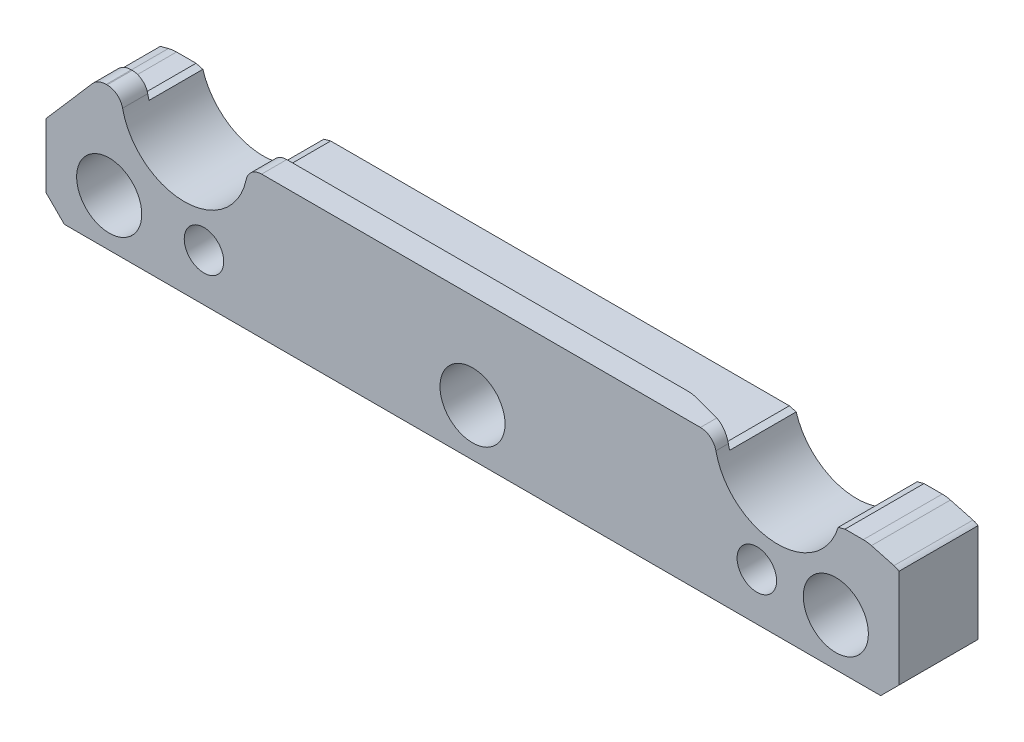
ISO-10303-21;
HEADER;
FILE_DESCRIPTION(('STEP AP214'),'2;1');
FILE_NAME('part.step','',(''),(''),'','','');
FILE_SCHEMA(('AUTOMOTIVE_DESIGN { 1 0 10303 214 1 1 1 1 }'));
ENDSEC;
DATA;
#1=APPLICATION_CONTEXT('core data for automotive mechanical design processes');
#2=APPLICATION_PROTOCOL_DEFINITION('international standard','automotive_design',2000,#1);
#3=PRODUCT_CONTEXT('',#1,'mechanical');
#4=PRODUCT('Part','Part','',(#3));
#5=PRODUCT_RELATED_PRODUCT_CATEGORY('part','',(#4));
#6=PRODUCT_DEFINITION_FORMATION('','',#4);
#7=PRODUCT_DEFINITION_CONTEXT('part definition',#1,'design');
#8=PRODUCT_DEFINITION('design','',#6,#7);
#9=PRODUCT_DEFINITION_SHAPE('','',#8);
#10=(LENGTH_UNIT() NAMED_UNIT(*) SI_UNIT(.MILLI.,.METRE.));
#11=(NAMED_UNIT(*) PLANE_ANGLE_UNIT() SI_UNIT($,.RADIAN.));
#12=(NAMED_UNIT(*) SI_UNIT($,.STERADIAN.) SOLID_ANGLE_UNIT());
#13=UNCERTAINTY_MEASURE_WITH_UNIT(LENGTH_MEASURE(1.E-05),#10,'distance_accuracy_value','');
#14=(GEOMETRIC_REPRESENTATION_CONTEXT(3) GLOBAL_UNCERTAINTY_ASSIGNED_CONTEXT((#13)) GLOBAL_UNIT_ASSIGNED_CONTEXT((#10,
#11,#12)) REPRESENTATION_CONTEXT('',''));
#15=CARTESIAN_POINT('',(0.,0.,0.));
#16=DIRECTION('',(0.,0.,1.));
#17=DIRECTION('',(1.,0.,0.));
#18=AXIS2_PLACEMENT_3D('',#15,#16,#17);
#19=CARTESIAN_POINT('',(-166.06299335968,-88.011,0.));
#20=DIRECTION('',(0.,0.,1.));
#21=DIRECTION('',(1.,0.,0.));
#22=AXIS2_PLACEMENT_3D('',#19,#20,#21);
#23=PLANE('',#22);
#24=CARTESIAN_POINT('',(-187.452,-97.536,0.));
#25=DIRECTION('',(0.,0.,-1.));
#26=DIRECTION('',(-1.,0.,0.));
#27=AXIS2_PLACEMENT_3D('',#24,#25,#26);
#28=CIRCLE('',#27,3.96874999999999);
#29=CARTESIAN_POINT('',(-191.42075,-97.536,0.));
#30=VERTEX_POINT('',#29);
#31=EDGE_CURVE('E272',#30,#30,#28,.T.);
#32=ORIENTED_EDGE('',*,*,#31,.F.);
#33=EDGE_LOOP('',(#32));
#34=FACE_BOUND('',#33,.T.);
#35=CARTESIAN_POINT('',(-171.577,-97.536,0.));
#36=DIRECTION('',(0.,0.,1.));
#37=DIRECTION('',(1.,0.,0.));
#38=AXIS2_PLACEMENT_3D('',#35,#36,#37);
#39=CIRCLE('',#38,4.36880000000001);
#40=CARTESIAN_POINT('',(-167.2082,-97.536,0.));
#41=VERTEX_POINT('',#40);
#42=EDGE_CURVE('E263',#41,#41,#39,.T.);
#43=ORIENTED_EDGE('',*,*,#42,.T.);
#44=EDGE_LOOP('',(#43));
#45=FACE_BOUND('',#44,.T.);
#46=CARTESIAN_POINT('',(-298.577,-97.536,0.));
#47=DIRECTION('',(0.,0.,-1.));
#48=DIRECTION('',(-1.,0.,0.));
#49=AXIS2_PLACEMENT_3D('',#46,#47,#48);
#50=CIRCLE('',#49,3.96875000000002);
#51=CARTESIAN_POINT('',(-302.54575,-97.536,0.));
#52=VERTEX_POINT('',#51);
#53=EDGE_CURVE('E592',#52,#52,#50,.T.);
#54=ORIENTED_EDGE('',*,*,#53,.F.);
#55=EDGE_LOOP('',(#54));
#56=FACE_BOUND('',#55,.T.);
#57=CARTESIAN_POINT('',(-317.627,-97.536,0.));
#58=DIRECTION('',(0.,0.,1.));
#59=DIRECTION('',(1.,0.,0.));
#60=AXIS2_PLACEMENT_3D('',#57,#58,#59);
#61=CIRCLE('',#60,4.36880000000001);
#62=CARTESIAN_POINT('',(-313.2582,-97.536,0.));
#63=VERTEX_POINT('',#62);
#64=EDGE_CURVE('E595',#63,#63,#61,.T.);
#65=ORIENTED_EDGE('',*,*,#64,.T.);
#66=EDGE_LOOP('',(#65));
#67=FACE_BOUND('',#66,.T.);
#68=CARTESIAN_POINT('',(-244.602,-97.536,0.));
#69=DIRECTION('',(0.,0.,1.));
#70=DIRECTION('',(1.,0.,0.));
#71=AXIS2_PLACEMENT_3D('',#68,#69,#70);
#72=CIRCLE('',#71,4.36880000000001);
#73=CARTESIAN_POINT('',(-240.2332,-97.536,0.));
#74=VERTEX_POINT('',#73);
#75=EDGE_CURVE('E607',#74,#74,#72,.T.);
#76=ORIENTED_EDGE('',*,*,#75,.T.);
#77=EDGE_LOOP('',(#76));
#78=FACE_BOUND('',#77,.T.);
#79=DIRECTION('',(0.,-1.,0.));
#80=VECTOR('',#79,1.);
#81=CARTESIAN_POINT('',(-330.327,-84.2132160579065,0.));
#82=LINE('',#81,#80);
#83=CARTESIAN_POINT('',(-330.327,-90.483615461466,0.));
#84=VERTEX_POINT('',#83);
#85=CARTESIAN_POINT('',(-330.327,-103.378,0.));
#86=VERTEX_POINT('',#85);
#87=EDGE_CURVE('E294',#84,#86,#82,.T.);
#88=ORIENTED_EDGE('',*,*,#87,.F.);
#89=DIRECTION('',(0.655690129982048,0.755030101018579,0.));
#90=VECTOR('',#89,1.);
#91=CARTESIAN_POINT('',(-365.518518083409,-131.006805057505,0.));
#92=LINE('',#91,#90);
#93=CARTESIAN_POINT('',(-323.2302175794,-82.3116389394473,0.));
#94=VERTEX_POINT('',#93);
#95=EDGE_CURVE('E259',#84,#94,#92,.T.);
#96=ORIENTED_EDGE('',*,*,#95,.T.);
#97=DIRECTION('',(-0.965925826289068,-0.258819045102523,0.));
#98=VECTOR('',#97,1.);
#99=CARTESIAN_POINT('',(-321.609507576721,-81.8773710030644,0.));
#100=LINE('',#99,#98);
#101=CARTESIAN_POINT('',(-321.609507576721,-81.8773710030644,0.));
#102=VERTEX_POINT('',#101);
#103=EDGE_CURVE('E279',#102,#94,#100,.T.);
#104=ORIENTED_EDGE('',*,*,#103,.F.);
#105=CARTESIAN_POINT('',(-319.96600664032,-88.011,0.));
#106=DIRECTION('',(0.,0.,1.));
#107=DIRECTION('',(-1.,0.,0.));
#108=AXIS2_PLACEMENT_3D('',#105,#106,#107);
#109=CIRCLE('',#108,6.34999999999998);
#110=CARTESIAN_POINT('',(-319.96600664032,-81.6610000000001,0.));
#111=VERTEX_POINT('',#110);
#112=EDGE_CURVE('E285',#111,#102,#109,.T.);
#113=ORIENTED_EDGE('',*,*,#112,.F.);
#114=DIRECTION('',(-1.,0.,0.));
#115=VECTOR('',#114,1.);
#116=CARTESIAN_POINT('',(-166.06299335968,-81.661,0.));
#117=LINE('',#116,#115);
#118=CARTESIAN_POINT('',(-316.047229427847,-81.6610000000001,0.));
#119=VERTEX_POINT('',#118);
#120=EDGE_CURVE('E307',#119,#111,#117,.T.);
#121=ORIENTED_EDGE('',*,*,#120,.F.);
#122=DIRECTION('',(0.965925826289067,-0.258819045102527,0.));
#123=VECTOR('',#122,1.);
#124=CARTESIAN_POINT('',(-316.047229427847,-81.6610000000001,0.));
#125=LINE('',#124,#123);
#126=CARTESIAN_POINT('',(-314.672023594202,-82.0294852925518,0.));
#127=VERTEX_POINT('',#126);
#128=EDGE_CURVE('E693',#119,#127,#125,.T.);
#129=ORIENTED_EDGE('',*,*,#128,.T.);
#130=CARTESIAN_POINT('',(-302.514,-78.3590000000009,0.));
#131=DIRECTION('',(0.,0.,1.));
#132=DIRECTION('',(1.,0.,0.));
#133=AXIS2_PLACEMENT_3D('',#130,#131,#132);
#134=CIRCLE('',#133,12.7);
#135=CARTESIAN_POINT('',(-290.355976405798,-82.0294852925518,0.));
#136=VERTEX_POINT('',#135);
#137=EDGE_CURVE('E575',#127,#136,#134,.T.);
#138=ORIENTED_EDGE('',*,*,#137,.T.);
#139=DIRECTION('',(-0.965925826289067,-0.258819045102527,0.));
#140=VECTOR('',#139,1.);
#141=CARTESIAN_POINT('',(-288.980770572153,-81.6610000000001,0.));
#142=LINE('',#141,#140);
#143=CARTESIAN_POINT('',(-288.980770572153,-81.6610000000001,0.));
#144=VERTEX_POINT('',#143);
#145=EDGE_CURVE('E673',#136,#144,#142,.F.);
#146=ORIENTED_EDGE('',*,*,#145,.T.);
#147=CARTESIAN_POINT('',(-196.794229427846,-81.661,0.));
#148=VERTEX_POINT('',#147);
#149=EDGE_CURVE('E311',#148,#144,#117,.T.);
#150=ORIENTED_EDGE('',*,*,#149,.F.);
#151=DIRECTION('',(0.965925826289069,-0.258819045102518,0.));
#152=VECTOR('',#151,1.);
#153=CARTESIAN_POINT('',(-196.794229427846,-81.661,0.));
#154=LINE('',#153,#152);
#155=CARTESIAN_POINT('',(-195.419023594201,-82.0294852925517,0.));
#156=VERTEX_POINT('',#155);
#157=EDGE_CURVE('E689',#148,#156,#154,.T.);
#158=ORIENTED_EDGE('',*,*,#157,.T.);
#159=CARTESIAN_POINT('',(-183.261,-78.359,0.));
#160=DIRECTION('',(0.,0.,1.));
#161=DIRECTION('',(1.,0.,0.));
#162=AXIS2_PLACEMENT_3D('',#159,#160,#161);
#163=CIRCLE('',#162,12.7);
#164=CARTESIAN_POINT('',(-171.102976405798,-82.0294852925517,0.));
#165=VERTEX_POINT('',#164);
#166=EDGE_CURVE('E574',#156,#165,#163,.T.);
#167=ORIENTED_EDGE('',*,*,#166,.T.);
#168=DIRECTION('',(-0.965925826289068,-0.258819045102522,0.));
#169=VECTOR('',#168,1.);
#170=CARTESIAN_POINT('',(-169.727770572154,-81.661,0.));
#171=LINE('',#170,#169);
#172=CARTESIAN_POINT('',(-169.727770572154,-81.661,0.));
#173=VERTEX_POINT('',#172);
#174=EDGE_CURVE('E691',#165,#173,#171,.F.);
#175=ORIENTED_EDGE('',*,*,#174,.T.);
#176=CARTESIAN_POINT('',(-166.06299335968,-81.661,0.));
#177=VERTEX_POINT('',#176);
#178=EDGE_CURVE('E308',#177,#173,#117,.T.);
#179=ORIENTED_EDGE('',*,*,#178,.F.);
#180=CARTESIAN_POINT('',(-166.06299335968,-88.011,0.));
#181=DIRECTION('',(0.,0.,1.));
#182=DIRECTION('',(1.,0.,0.));
#183=AXIS2_PLACEMENT_3D('',#180,#181,#182);
#184=CIRCLE('',#183,6.34999999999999);
#185=CARTESIAN_POINT('',(-164.419492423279,-81.8773710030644,0.));
#186=VERTEX_POINT('',#185);
#187=EDGE_CURVE('E304',#186,#177,#184,.T.);
#188=ORIENTED_EDGE('',*,*,#187,.F.);
#189=DIRECTION('',(-0.965925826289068,0.258819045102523,0.));
#190=VECTOR('',#189,1.);
#191=CARTESIAN_POINT('',(-158.877,-83.3624773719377,0.));
#192=LINE('',#191,#190);
#193=CARTESIAN_POINT('',(-159.888008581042,-83.0915784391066,0.));
#194=VERTEX_POINT('',#193);
#195=EDGE_CURVE('E302',#194,#186,#192,.T.);
#196=ORIENTED_EDGE('',*,*,#195,.F.);
#197=CARTESIAN_POINT('',(-160.709759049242,-86.1583929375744,0.));
#198=DIRECTION('',(0.,0.,1.));
#199=DIRECTION('',(1.,0.,0.));
#200=AXIS2_PLACEMENT_3D('',#197,#198,#199);
#201=CIRCLE('',#200,3.175);
#202=CARTESIAN_POINT('',(-158.877,-83.5657843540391,0.));
#203=VERTEX_POINT('',#202);
#204=EDGE_CURVE('E560',#203,#194,#201,.T.);
#205=ORIENTED_EDGE('',*,*,#204,.F.);
#206=DIRECTION('',(0.,1.,0.));
#207=VECTOR('',#206,1.);
#208=CARTESIAN_POINT('',(-158.877,-83.3624773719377,0.));
#209=LINE('',#208,#207);
#210=CARTESIAN_POINT('',(-158.877,-103.378,0.));
#211=VERTEX_POINT('',#210);
#212=EDGE_CURVE('E299',#211,#203,#209,.T.);
#213=ORIENTED_EDGE('',*,*,#212,.F.);
#214=DIRECTION('',(0.707106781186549,0.707106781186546,0.));
#215=VECTOR('',#214,1.);
#216=CARTESIAN_POINT('',(-158.877,-103.378,0.));
#217=LINE('',#216,#215);
#218=CARTESIAN_POINT('',(-162.56,-107.061,0.));
#219=VERTEX_POINT('',#218);
#220=EDGE_CURVE('E328',#211,#219,#217,.F.);
#221=ORIENTED_EDGE('',*,*,#220,.T.);
#222=DIRECTION('',(1.,0.,0.));
#223=VECTOR('',#222,1.);
#224=CARTESIAN_POINT('',(-158.877,-107.061,0.));
#225=LINE('',#224,#223);
#226=CARTESIAN_POINT('',(-326.644,-107.061,0.));
#227=VERTEX_POINT('',#226);
#228=EDGE_CURVE('E296',#227,#219,#225,.T.);
#229=ORIENTED_EDGE('',*,*,#228,.F.);
#230=DIRECTION('',(0.707106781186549,-0.707106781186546,0.));
#231=VECTOR('',#230,1.);
#232=CARTESIAN_POINT('',(-326.644,-107.061,0.));
#233=LINE('',#232,#231);
#234=EDGE_CURVE('E330',#227,#86,#233,.F.);
#235=ORIENTED_EDGE('',*,*,#234,.T.);
#236=EDGE_LOOP('',(#88,#96,#104,#113,#121,#129,#138,#146,#150,#158,#167,#175,#179,#188,#196,
#205,#213,#221,#229,#235));
#237=FACE_BOUND('',#236,.T.);
#238=ADVANCED_FACE('F49',(#34,#45,#56,#67,#78,#237),#23,.F.);
#239=CARTESIAN_POINT('',(-166.06299335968,-81.661,15.875));
#240=DIRECTION('',(0.,-1.,0.));
#241=DIRECTION('',(1.,0.,0.));
#242=AXIS2_PLACEMENT_3D('',#239,#240,#241);
#243=PLANE('',#242);
#244=CARTESIAN_POINT('',(-205.239339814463,-81.661,10.8199999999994));
#245=CARTESIAN_POINT('',(-204.430193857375,-81.661,11.034381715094));
#246=CARTESIAN_POINT('',(-203.62099333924,-81.661,11.2485583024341));
#247=CARTESIAN_POINT('',(-202.002409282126,-81.661,11.6762125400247));
#248=CARTESIAN_POINT('',(-201.19302574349,-81.661,11.8896901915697));
#249=CARTESIAN_POINT('',(-199.573997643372,-81.661,12.3156589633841));
#250=CARTESIAN_POINT('',(-198.764353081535,-81.661,12.5281500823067));
#251=CARTESIAN_POINT('',(-197.549581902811,-81.661,12.8457260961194));
#252=CARTESIAN_POINT('',(-197.144607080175,-81.661,12.9513914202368));
#253=CARTESIAN_POINT('',(-196.334525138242,-81.661,13.1622145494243));
#254=CARTESIAN_POINT('',(-195.92941801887,-81.661,13.2673723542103));
#255=CARTESIAN_POINT('',(-195.524229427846,-81.661,13.3722160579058));
#256=B_SPLINE_CURVE_WITH_KNOTS('',3,(#244,#245,#246,#247,#248,#249,#250,#251,#252,#253,#254,
#255),.UNSPECIFIED.,.F.,.F.,(4,2,2,2,2,4),(0.,2.51119326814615,5.02238188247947,7.5335739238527,
8.7891722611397,10.0447713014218),.UNSPECIFIED.);
#257=CARTESIAN_POINT('',(-204.42242192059,-81.661,11.0363710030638));
#258=VERTEX_POINT('',#257);
#259=CARTESIAN_POINT('',(-196.794229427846,-81.661,13.0425750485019));
#260=VERTEX_POINT('',#259);
#261=EDGE_CURVE('E352',#258,#260,#256,.T.);
#262=ORIENTED_EDGE('',*,*,#261,.T.);
#263=DIRECTION('',(0.,0.,-1.));
#264=VECTOR('',#263,1.);
#265=CARTESIAN_POINT('',(-196.794229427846,-81.661,15.875));
#266=LINE('',#265,#264);
#267=EDGE_CURVE('E695',#260,#148,#266,.T.);
#268=ORIENTED_EDGE('',*,*,#267,.T.);
#269=ORIENTED_EDGE('',*,*,#149,.T.);
#270=DIRECTION('',(0.,0.,1.));
#271=VECTOR('',#270,1.);
#272=CARTESIAN_POINT('',(-288.980770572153,-81.6610000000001,15.875));
#273=LINE('',#272,#271);
#274=CARTESIAN_POINT('',(-288.980770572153,-81.6610000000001,10.8199999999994));
#275=VERTEX_POINT('',#274);
#276=EDGE_CURVE('E391',#144,#275,#273,.T.);
#277=ORIENTED_EDGE('',*,*,#276,.T.);
#278=DIRECTION('',(1.,0.,0.));
#279=VECTOR('',#278,1.);
#280=CARTESIAN_POINT('',(-166.06299335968,-81.661,10.8199999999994));
#281=LINE('',#280,#279);
#282=CARTESIAN_POINT('',(-206.08436983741,-81.661,10.8199999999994));
#283=VERTEX_POINT('',#282);
#284=EDGE_CURVE('E621',#275,#283,#281,.T.);
#285=ORIENTED_EDGE('',*,*,#284,.T.);
#286=CARTESIAN_POINT('',(-206.08436983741,-81.661,10.8199999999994));
#287=CARTESIAN_POINT('',(-205.944020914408,-81.661,10.8199939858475));
#288=CARTESIAN_POINT('',(-205.803673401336,-81.661,10.8245576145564));
#289=CARTESIAN_POINT('',(-205.524152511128,-81.661,10.8427304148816));
#290=CARTESIAN_POINT('',(-205.384976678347,-81.661,10.856301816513));
#291=CARTESIAN_POINT('',(-205.107792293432,-81.661,10.8923972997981));
#292=CARTESIAN_POINT('',(-204.969783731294,-81.661,10.9149213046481));
#293=CARTESIAN_POINT('',(-204.694930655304,-81.661,10.9689273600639));
#294=CARTESIAN_POINT('',(-204.558093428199,-81.661,11.0004464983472));
#295=CARTESIAN_POINT('',(-204.42242192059,-81.661,11.0363710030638));
#296=B_SPLINE_CURVE_WITH_KNOTS('',3,(#286,#287,#288,#289,#290,#291,#292,#293,#294,#295),
.UNSPECIFIED.,.F.,.F.,(4,2,2,2,4),(0.,0.420970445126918,0.840186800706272,1.25939955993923,
1.68036637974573),.UNSPECIFIED.);
#297=EDGE_CURVE('E459',#283,#258,#296,.T.);
#298=ORIENTED_EDGE('',*,*,#297,.T.);
#299=EDGE_LOOP('',(#262,#268,#269,#277,#285,#298));
#300=FACE_BOUND('',#299,.T.);
#301=ADVANCED_FACE('F476',(#300),#243,.F.);
#302=ORIENTED_EDGE('',*,*,#178,.T.);
#303=DIRECTION('',(0.,0.,1.));
#304=VECTOR('',#303,1.);
#305=CARTESIAN_POINT('',(-169.727770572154,-81.661,15.875));
#306=LINE('',#305,#304);
#307=CARTESIAN_POINT('',(-169.727770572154,-81.661,15.875));
#308=VERTEX_POINT('',#307);
#309=EDGE_CURVE('E681',#173,#308,#306,.T.);
#310=ORIENTED_EDGE('',*,*,#309,.T.);
#311=DIRECTION('',(1.,0.,0.));
#312=VECTOR('',#311,1.);
#313=CARTESIAN_POINT('',(-170.997770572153,-81.661,15.875));
#314=LINE('',#313,#312);
#315=CARTESIAN_POINT('',(-166.06299335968,-81.661,15.875));
#316=VERTEX_POINT('',#315);
#317=EDGE_CURVE('E564',#308,#316,#314,.T.);
#318=ORIENTED_EDGE('',*,*,#317,.T.);
#319=DIRECTION('',(0.,0.,-1.));
#320=VECTOR('',#319,1.);
#321=CARTESIAN_POINT('',(-166.06299335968,-81.661,15.875));
#322=LINE('',#321,#320);
#323=EDGE_CURVE('E318',#316,#177,#322,.T.);
#324=ORIENTED_EDGE('',*,*,#323,.T.);
#325=EDGE_LOOP('',(#302,#310,#318,#324));
#326=FACE_BOUND('',#325,.T.);
#327=ADVANCED_FACE('F477',(#326),#243,.F.);
#328=CARTESIAN_POINT('',(-359.345677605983,-107.061,10.8199999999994));
#329=DIRECTION('',(0.,0.,-1.));
#330=DIRECTION('',(-1.,0.,0.));
#331=AXIS2_PLACEMENT_3D('',#328,#329,#330);
#332=PLANE('',#331);
#333=CARTESIAN_POINT('',(-302.514,-78.3590000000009,10.8199999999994));
#334=DIRECTION('',(0.,0.,-1.));
#335=DIRECTION('',(-1.,0.,0.));
#336=AXIS2_PLACEMENT_3D('',#333,#334,#335);
#337=CIRCLE('',#336,12.7);
#338=CARTESIAN_POINT('',(-290.091763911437,-81.0006000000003,10.8199999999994));
#339=VERTEX_POINT('',#338);
#340=CARTESIAN_POINT('',(-290.355976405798,-82.0294852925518,10.8199999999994));
#341=VERTEX_POINT('',#340);
#342=EDGE_CURVE('E578',#339,#341,#337,.T.);
#343=ORIENTED_EDGE('',*,*,#342,.F.);
#344=CARTESIAN_POINT('',(-286.986204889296,-81.6610000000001,10.8199999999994));
#345=DIRECTION('',(0.,0.,-1.));
#346=DIRECTION('',(-1.,0.,0.));
#347=AXIS2_PLACEMENT_3D('',#344,#345,#346);
#348=CIRCLE('',#347,3.175);
#349=CARTESIAN_POINT('',(-286.986204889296,-78.486,10.8199999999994));
#350=VERTEX_POINT('',#349);
#351=EDGE_CURVE('E640',#339,#350,#348,.T.);
#352=ORIENTED_EDGE('',*,*,#351,.T.);
#353=DIRECTION('',(1.,0.,0.));
#354=VECTOR('',#353,1.);
#355=CARTESIAN_POINT('',(-359.345677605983,-78.486,10.8199999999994));
#356=LINE('',#355,#354);
#357=CARTESIAN_POINT('',(-206.321643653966,-78.486,10.8199999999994));
#358=VERTEX_POINT('',#357);
#359=EDGE_CURVE('E622',#350,#358,#356,.T.);
#360=ORIENTED_EDGE('',*,*,#359,.T.);
#361=CARTESIAN_POINT('',(-183.261,-78.359,10.8199999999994));
#362=DIRECTION('',(0.,0.,-1.));
#363=DIRECTION('',(-1.,0.,0.));
#364=AXIS2_PLACEMENT_3D('',#361,#362,#363);
#365=CIRCLE('',#364,23.0609933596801);
#366=EDGE_CURVE('E1163',#358,#283,#365,.F.);
#367=ORIENTED_EDGE('',*,*,#366,.T.);
#368=ORIENTED_EDGE('',*,*,#284,.F.);
#369=DIRECTION('',(0.965925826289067,0.258819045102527,0.));
#370=VECTOR('',#369,1.);
#371=CARTESIAN_POINT('',(-288.980770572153,-81.6610000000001,10.8199999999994));
#372=LINE('',#371,#370);
#373=EDGE_CURVE('E426',#275,#341,#372,.F.);
#374=ORIENTED_EDGE('',*,*,#373,.T.);
#375=EDGE_LOOP('',(#343,#352,#360,#367,#368,#374));
#376=FACE_BOUND('',#375,.T.);
#377=ADVANCED_FACE('F663',(#376),#332,.T.);
#378=CARTESIAN_POINT('',(-359.345677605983,-78.486,10.8199999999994));
#379=DIRECTION('',(0.,1.,0.));
#380=DIRECTION('',(0.,0.,1.));
#381=AXIS2_PLACEMENT_3D('',#378,#379,#380);
#382=PLANE('',#381);
#383=CARTESIAN_POINT('',(-318.228394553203,-78.486,10.8199999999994));
#384=VERTEX_POINT('',#383);
#385=CARTESIAN_POINT('',(-318.041795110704,-78.486,10.8199999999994));
#386=VERTEX_POINT('',#385);
#387=EDGE_CURVE('E620',#384,#386,#356,.T.);
#388=ORIENTED_EDGE('',*,*,#387,.F.);
#389=DIRECTION('',(0.,0.,-1.));
#390=VECTOR('',#389,1.);
#391=CARTESIAN_POINT('',(-318.228394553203,-78.486,15.875));
#392=LINE('',#391,#390);
#393=CARTESIAN_POINT('',(-318.228394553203,-78.486,15.875));
#394=VERTEX_POINT('',#393);
#395=EDGE_CURVE('E58',#384,#394,#392,.F.);
#396=ORIENTED_EDGE('',*,*,#395,.T.);
#397=DIRECTION('',(1.,0.,0.));
#398=VECTOR('',#397,1.);
#399=CARTESIAN_POINT('',(-359.345677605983,-78.486,15.875));
#400=LINE('',#399,#398);
#401=CARTESIAN_POINT('',(-318.041795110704,-78.486,15.875));
#402=VERTEX_POINT('',#401);
#403=EDGE_CURVE('E623',#394,#402,#400,.T.);
#404=ORIENTED_EDGE('',*,*,#403,.T.);
#405=DIRECTION('',(0.,0.,-1.));
#406=VECTOR('',#405,1.);
#407=CARTESIAN_POINT('',(-318.041795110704,-78.486,10.8199999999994));
#408=LINE('',#407,#406);
#409=EDGE_CURVE('E646',#402,#386,#408,.T.);
#410=ORIENTED_EDGE('',*,*,#409,.T.);
#411=EDGE_LOOP('',(#388,#396,#404,#410));
#412=FACE_BOUND('',#411,.T.);
#413=ADVANCED_FACE('F359',(#412),#382,.T.);
#414=ORIENTED_EDGE('',*,*,#359,.F.);
#415=DIRECTION('',(0.,0.,-1.));
#416=VECTOR('',#415,1.);
#417=CARTESIAN_POINT('',(-286.986204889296,-78.486,15.875));
#418=LINE('',#417,#416);
#419=CARTESIAN_POINT('',(-286.986204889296,-78.486,15.875));
#420=VERTEX_POINT('',#419);
#421=EDGE_CURVE('E634',#350,#420,#418,.F.);
#422=ORIENTED_EDGE('',*,*,#421,.T.);
#423=CARTESIAN_POINT('',(-198.788795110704,-78.486,15.875));
#424=VERTEX_POINT('',#423);
#425=EDGE_CURVE('E619',#420,#424,#400,.T.);
#426=ORIENTED_EDGE('',*,*,#425,.T.);
#427=DIRECTION('',(0.,0.,-1.));
#428=VECTOR('',#427,1.);
#429=CARTESIAN_POINT('',(-198.788795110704,-78.486,13.3722160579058));
#430=LINE('',#429,#428);
#431=CARTESIAN_POINT('',(-198.788795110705,-78.486,12.6143714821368));
#432=VERTEX_POINT('',#431);
#433=EDGE_CURVE('E631',#424,#432,#430,.T.);
#434=ORIENTED_EDGE('',*,*,#433,.T.);
#435=CARTESIAN_POINT('',(-195.960364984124,-78.4860000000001,13.3722160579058));
#436=CARTESIAN_POINT('',(-197.547912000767,-78.4860000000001,12.9468529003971));
#437=CARTESIAN_POINT('',(-199.135458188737,-78.486,12.5214866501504));
#438=CARTESIAN_POINT('',(-202.310548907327,-78.486,11.6707479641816));
#439=CARTESIAN_POINT('',(-203.898093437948,-78.486,11.2453755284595));
#440=CARTESIAN_POINT('',(-205.485637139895,-78.486,10.8199999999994));
#441=B_SPLINE_CURVE_WITH_KNOTS('',3,(#435,#436,#437,#438,#439,#440),.UNSPECIFIED.,.F.,.F.,(4,2,
4),(0.,4.93063425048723,9.86126850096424),.UNSPECIFIED.);
#442=CARTESIAN_POINT('',(-204.678115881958,-78.486,11.0363710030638));
#443=VERTEX_POINT('',#442);
#444=EDGE_CURVE('E344',#432,#443,#441,.T.);
#445=ORIENTED_EDGE('',*,*,#444,.T.);
#446=CARTESIAN_POINT('',(-204.678115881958,-78.486,11.0363710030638));
#447=CARTESIAN_POINT('',(-204.812218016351,-78.486,11.0004323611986));
#448=CARTESIAN_POINT('',(-204.947501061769,-78.486,10.9689043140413));
#449=CARTESIAN_POINT('',(-205.219260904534,-78.486,10.914891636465));
#450=CARTESIAN_POINT('',(-205.355730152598,-78.486,10.8923690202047));
#451=CARTESIAN_POINT('',(-205.629847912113,-78.486,10.856281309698));
#452=CARTESIAN_POINT('',(-205.76749642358,-78.486,10.8427162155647));
#453=CARTESIAN_POINT('',(-206.043975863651,-78.486,10.8245529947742));
#454=CARTESIAN_POINT('',(-206.182809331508,-78.486,10.8199935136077));
#455=CARTESIAN_POINT('',(-206.321643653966,-78.486,10.8199999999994));
#456=B_SPLINE_CURVE_WITH_KNOTS('',3,(#446,#447,#448,#449,#450,#451,#452,#453,#454,#455),
.UNSPECIFIED.,.F.,.F.,(4,2,2,2,4),(0.,0.416426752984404,0.831077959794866,1.24572917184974,
1.66215593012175),.UNSPECIFIED.);
#457=EDGE_CURVE('E451',#443,#358,#456,.T.);
#458=ORIENTED_EDGE('',*,*,#457,.T.);
#459=EDGE_LOOP('',(#414,#422,#426,#434,#445,#458));
#460=FACE_BOUND('',#459,.T.);
#461=ADVANCED_FACE('F496',(#460),#382,.T.);
#462=CARTESIAN_POINT('',(-330.327,-84.2132160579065,15.875));
#463=DIRECTION('',(1.,0.,0.));
#464=DIRECTION('',(0.,1.,0.));
#465=AXIS2_PLACEMENT_3D('',#462,#463,#464);
#466=PLANE('',#465);
#467=DIRECTION('',(0.,-1.,0.));
#468=VECTOR('',#467,1.);
#469=CARTESIAN_POINT('',(-330.327,-84.2132160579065,15.875));
#470=LINE('',#469,#468);
#471=CARTESIAN_POINT('',(-330.327,-90.483615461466,15.875));
#472=VERTEX_POINT('',#471);
#473=CARTESIAN_POINT('',(-330.327,-103.378,15.875));
#474=VERTEX_POINT('',#473);
#475=EDGE_CURVE('E269',#472,#474,#470,.T.);
#476=ORIENTED_EDGE('',*,*,#475,.F.);
#477=DIRECTION('',(0.,0.,-1.));
#478=VECTOR('',#477,1.);
#479=CARTESIAN_POINT('',(-330.327,-90.483615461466,15.875));
#480=LINE('',#479,#478);
#481=EDGE_CURVE('E252',#472,#84,#480,.T.);
#482=ORIENTED_EDGE('',*,*,#481,.T.);
#483=ORIENTED_EDGE('',*,*,#87,.T.);
#484=DIRECTION('',(0.,0.,1.));
#485=VECTOR('',#484,1.);
#486=CARTESIAN_POINT('',(-330.327,-103.378,15.875));
#487=LINE('',#486,#485);
#488=EDGE_CURVE('E276',#86,#474,#487,.T.);
#489=ORIENTED_EDGE('',*,*,#488,.T.);
#490=EDGE_LOOP('',(#476,#482,#483,#489));
#491=FACE_BOUND('',#490,.T.);
#492=ADVANCED_FACE('F274',(#491),#466,.F.);
#493=CARTESIAN_POINT('',(-158.877,-107.061,15.875));
#494=DIRECTION('',(0.,1.,0.));
#495=DIRECTION('',(-1.,0.,0.));
#496=AXIS2_PLACEMENT_3D('',#493,#494,#495);
#497=PLANE('',#496);
#498=DIRECTION('',(1.,0.,0.));
#499=VECTOR('',#498,1.);
#500=CARTESIAN_POINT('',(-158.877,-107.061,15.875));
#501=LINE('',#500,#499);
#502=CARTESIAN_POINT('',(-326.644,-107.061,15.875));
#503=VERTEX_POINT('',#502);
#504=CARTESIAN_POINT('',(-162.56,-107.061,15.875));
#505=VERTEX_POINT('',#504);
#506=EDGE_CURVE('E278',#503,#505,#501,.T.);
#507=ORIENTED_EDGE('',*,*,#506,.F.);
#508=DIRECTION('',(0.,0.,-1.));
#509=VECTOR('',#508,1.);
#510=CARTESIAN_POINT('',(-326.644,-107.061,15.875));
#511=LINE('',#510,#509);
#512=EDGE_CURVE('E325',#503,#227,#511,.T.);
#513=ORIENTED_EDGE('',*,*,#512,.T.);
#514=ORIENTED_EDGE('',*,*,#228,.T.);
#515=DIRECTION('',(0.,0.,1.));
#516=VECTOR('',#515,1.);
#517=CARTESIAN_POINT('',(-162.56,-107.061,15.875));
#518=LINE('',#517,#516);
#519=EDGE_CURVE('E323',#219,#505,#518,.T.);
#520=ORIENTED_EDGE('',*,*,#519,.T.);
#521=EDGE_LOOP('',(#507,#513,#514,#520));
#522=FACE_BOUND('',#521,.T.);
#523=ADVANCED_FACE('F490',(#522),#497,.F.);
#524=CARTESIAN_POINT('',(-158.877,-83.3624773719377,15.875));
#525=DIRECTION('',(-1.,0.,0.));
#526=DIRECTION('',(0.,0.,1.));
#527=AXIS2_PLACEMENT_3D('',#524,#525,#526);
#528=PLANE('',#527);
#529=ORIENTED_EDGE('',*,*,#212,.T.);
#530=DIRECTION('',(0.,0.,1.));
#531=VECTOR('',#530,1.);
#532=CARTESIAN_POINT('',(-158.877,-83.5657843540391,-0.001000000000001));
#533=LINE('',#532,#531);
#534=CARTESIAN_POINT('',(-158.877,-83.5657843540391,15.875));
#535=VERTEX_POINT('',#534);
#536=EDGE_CURVE('E558',#535,#203,#533,.F.);
#537=ORIENTED_EDGE('',*,*,#536,.F.);
#538=DIRECTION('',(0.,1.,0.));
#539=VECTOR('',#538,1.);
#540=CARTESIAN_POINT('',(-158.877,-83.3624773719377,15.875));
#541=LINE('',#540,#539);
#542=CARTESIAN_POINT('',(-158.877,-103.378,15.875));
#543=VERTEX_POINT('',#542);
#544=EDGE_CURVE('E282',#543,#535,#541,.T.);
#545=ORIENTED_EDGE('',*,*,#544,.F.);
#546=DIRECTION('',(0.,0.,-1.));
#547=VECTOR('',#546,1.);
#548=CARTESIAN_POINT('',(-158.877,-103.378,15.875));
#549=LINE('',#548,#547);
#550=EDGE_CURVE('E338',#543,#211,#549,.T.);
#551=ORIENTED_EDGE('',*,*,#550,.T.);
#552=EDGE_LOOP('',(#529,#537,#545,#551));
#553=FACE_BOUND('',#552,.T.);
#554=ADVANCED_FACE('F486',(#553),#528,.F.);
#555=CARTESIAN_POINT('',(-158.877,-83.3624773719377,15.875));
#556=DIRECTION('',(-0.258819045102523,-0.965925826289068,0.));
#557=DIRECTION('',(0.965925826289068,-0.258819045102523,0.));
#558=AXIS2_PLACEMENT_3D('',#555,#556,#557);
#559=PLANE('',#558);
#560=DIRECTION('',(0.,0.,-1.));
#561=VECTOR('',#560,1.);
#562=CARTESIAN_POINT('',(-164.419492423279,-81.8773710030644,15.875));
#563=LINE('',#562,#561);
#564=CARTESIAN_POINT('',(-164.419492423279,-81.8773710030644,15.875));
#565=VERTEX_POINT('',#564);
#566=EDGE_CURVE('E320',#565,#186,#563,.T.);
#567=ORIENTED_EDGE('',*,*,#566,.F.);
#568=DIRECTION('',(0.965925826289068,-0.258819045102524,0.));
#569=VECTOR('',#568,1.);
#570=CARTESIAN_POINT('',(-164.419492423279,-81.8773710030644,15.875));
#571=LINE('',#570,#569);
#572=CARTESIAN_POINT('',(-159.888008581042,-83.0915784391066,15.875));
#573=VERTEX_POINT('',#572);
#574=EDGE_CURVE('E569',#565,#573,#571,.T.);
#575=ORIENTED_EDGE('',*,*,#574,.T.);
#576=DIRECTION('',(0.,0.,1.));
#577=VECTOR('',#576,1.);
#578=CARTESIAN_POINT('',(-159.888008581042,-83.0915784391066,-0.001000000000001));
#579=LINE('',#578,#577);
#580=EDGE_CURVE('E562',#194,#573,#579,.T.);
#581=ORIENTED_EDGE('',*,*,#580,.F.);
#582=ORIENTED_EDGE('',*,*,#195,.T.);
#583=EDGE_LOOP('',(#567,#575,#581,#582));
#584=FACE_BOUND('',#583,.T.);
#585=ADVANCED_FACE('F482',(#584),#559,.F.);
#586=CARTESIAN_POINT('',(-166.06299335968,-88.011,15.875));
#587=DIRECTION('',(0.,0.,-1.));
#588=DIRECTION('',(-1.,0.,0.));
#589=AXIS2_PLACEMENT_3D('',#586,#587,#588);
#590=CYLINDRICAL_SURFACE('',#589,6.34999999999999);
#591=ORIENTED_EDGE('',*,*,#323,.F.);
#592=CARTESIAN_POINT('',(-166.06299335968,-88.011,15.875));
#593=DIRECTION('',(0.,0.,-1.));
#594=DIRECTION('',(1.,0.,0.));
#595=AXIS2_PLACEMENT_3D('',#592,#593,#594);
#596=CIRCLE('',#595,6.34999999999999);
#597=EDGE_CURVE('E566',#316,#565,#596,.T.);
#598=ORIENTED_EDGE('',*,*,#597,.T.);
#599=ORIENTED_EDGE('',*,*,#566,.T.);
#600=ORIENTED_EDGE('',*,*,#187,.T.);
#601=EDGE_LOOP('',(#591,#598,#599,#600));
#602=FACE_BOUND('',#601,.T.);
#603=ADVANCED_FACE('F474',(#602),#590,.T.);
#604=CARTESIAN_POINT('',(-319.96600664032,-81.6610000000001,10.8199999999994));
#605=VERTEX_POINT('',#604);
#606=CARTESIAN_POINT('',(-316.047229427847,-81.6610000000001,10.8199999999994));
#607=VERTEX_POINT('',#606);
#608=EDGE_CURVE('E288',#605,#607,#281,.T.);
#609=ORIENTED_EDGE('',*,*,#608,.T.);
#610=DIRECTION('',(0.,0.,-1.));
#611=VECTOR('',#610,1.);
#612=CARTESIAN_POINT('',(-316.047229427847,-81.6610000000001,15.875));
#613=LINE('',#612,#611);
#614=EDGE_CURVE('E674',#607,#119,#613,.T.);
#615=ORIENTED_EDGE('',*,*,#614,.T.);
#616=ORIENTED_EDGE('',*,*,#120,.T.);
#617=DIRECTION('',(0.,0.,-1.));
#618=VECTOR('',#617,1.);
#619=CARTESIAN_POINT('',(-319.96600664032,-81.6610000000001,15.875));
#620=LINE('',#619,#618);
#621=EDGE_CURVE('E315',#605,#111,#620,.T.);
#622=ORIENTED_EDGE('',*,*,#621,.F.);
#623=EDGE_LOOP('',(#609,#615,#616,#622));
#624=FACE_BOUND('',#623,.T.);
#625=ADVANCED_FACE('F468',(#624),#243,.F.);
#626=CARTESIAN_POINT('',(-319.96600664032,-88.011,15.875));
#627=DIRECTION('',(0.,0.,-1.));
#628=DIRECTION('',(-1.,0.,0.));
#629=AXIS2_PLACEMENT_3D('',#626,#627,#628);
#630=CYLINDRICAL_SURFACE('',#629,6.34999999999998);
#631=DIRECTION('',(0.,0.,-1.));
#632=VECTOR('',#631,1.);
#633=CARTESIAN_POINT('',(-321.609507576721,-81.8773710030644,15.875));
#634=LINE('',#633,#632);
#635=CARTESIAN_POINT('',(-321.609507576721,-81.8773710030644,11.0363710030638));
#636=VERTEX_POINT('',#635);
#637=EDGE_CURVE('E293',#636,#102,#634,.T.);
#638=ORIENTED_EDGE('',*,*,#637,.F.);
#639=CARTESIAN_POINT('',(-319.96600664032,-88.011,17.1699999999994));
#640=DIRECTION('',(0.,-0.707106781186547,-0.707106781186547));
#641=DIRECTION('',(0.,0.707106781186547,-0.707106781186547));
#642=AXIS2_PLACEMENT_3D('',#639,#640,#641);
#643=ELLIPSE('',#642,8.98025612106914,6.34999999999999);
#644=EDGE_CURVE('E466',#636,#605,#643,.T.);
#645=ORIENTED_EDGE('',*,*,#644,.T.);
#646=ORIENTED_EDGE('',*,*,#621,.T.);
#647=ORIENTED_EDGE('',*,*,#112,.T.);
#648=EDGE_LOOP('',(#638,#645,#646,#647));
#649=FACE_BOUND('',#648,.T.);
#650=ADVANCED_FACE('F473',(#649),#630,.T.);
#651=CARTESIAN_POINT('',(-321.609507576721,-81.8773710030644,15.875));
#652=DIRECTION('',(0.258819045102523,-0.965925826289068,0.));
#653=DIRECTION('',(0.965925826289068,0.258819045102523,0.));
#654=AXIS2_PLACEMENT_3D('',#651,#652,#653);
#655=PLANE('',#654);
#656=ORIENTED_EDGE('',*,*,#103,.T.);
#657=DIRECTION('',(0.,0.,1.));
#658=VECTOR('',#657,1.);
#659=CARTESIAN_POINT('',(-323.2302175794,-82.3116389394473,15.875));
#660=LINE('',#659,#658);
#661=CARTESIAN_POINT('',(-323.2302175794,-82.3116389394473,11.4706389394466));
#662=VERTEX_POINT('',#661);
#663=EDGE_CURVE('E264',#94,#662,#660,.T.);
#664=ORIENTED_EDGE('',*,*,#663,.T.);
#665=DIRECTION('',(0.935113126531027,0.250562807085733,-0.250562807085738));
#666=VECTOR('',#665,1.);
#667=CARTESIAN_POINT('',(-322.743220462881,-82.1811484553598,11.3401484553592));
#668=LINE('',#667,#666);
#669=EDGE_CURVE('E1169',#662,#636,#668,.T.);
#670=ORIENTED_EDGE('',*,*,#669,.T.);
#671=ORIENTED_EDGE('',*,*,#637,.T.);
#672=EDGE_LOOP('',(#656,#664,#670,#671));
#673=FACE_BOUND('',#672,.T.);
#674=ADVANCED_FACE('F523',(#673),#655,.F.);
#675=CARTESIAN_POINT('',(-166.06299335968,-88.011,15.875));
#676=DIRECTION('',(0.,0.,1.));
#677=DIRECTION('',(1.,0.,0.));
#678=AXIS2_PLACEMENT_3D('',#675,#676,#677);
#679=PLANE('',#678);
#680=CARTESIAN_POINT('',(-187.452,-97.536,15.875));
#681=DIRECTION('',(0.,0.,-1.));
#682=DIRECTION('',(-1.,0.,0.));
#683=AXIS2_PLACEMENT_3D('',#680,#681,#682);
#684=CIRCLE('',#683,3.96874999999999);
#685=CARTESIAN_POINT('',(-191.42075,-97.536,15.875));
#686=VERTEX_POINT('',#685);
#687=EDGE_CURVE('E1178',#686,#686,#684,.T.);
#688=ORIENTED_EDGE('',*,*,#687,.T.);
#689=EDGE_LOOP('',(#688));
#690=FACE_BOUND('',#689,.T.);
#691=ORIENTED_EDGE('',*,*,#403,.F.);
#692=CARTESIAN_POINT('',(-318.228394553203,-82.169,15.875));
#693=DIRECTION('',(0.,0.,1.));
#694=DIRECTION('',(1.,0.,0.));
#695=AXIS2_PLACEMENT_3D('',#692,#693,#694);
#696=CIRCLE('',#695,3.683);
#697=CARTESIAN_POINT('',(-321.009170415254,-79.7540932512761,15.875));
#698=VERTEX_POINT('',#697);
#699=EDGE_CURVE('E11',#394,#698,#696,.T.);
#700=ORIENTED_EDGE('',*,*,#699,.T.);
#701=DIRECTION('',(0.655690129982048,0.755030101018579,0.));
#702=VECTOR('',#701,1.);
#703=CARTESIAN_POINT('',(-365.518518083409,-131.006805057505,15.875));
#704=LINE('',#703,#702);
#705=EDGE_CURVE('E256',#472,#698,#704,.T.);
#706=ORIENTED_EDGE('',*,*,#705,.F.);
#707=ORIENTED_EDGE('',*,*,#475,.T.);
#708=DIRECTION('',(-0.707106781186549,0.707106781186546,0.));
#709=VECTOR('',#708,1.);
#710=CARTESIAN_POINT('',(-255.87849667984,-177.82650332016,15.875));
#711=LINE('',#710,#709);
#712=EDGE_CURVE('E336',#474,#503,#711,.F.);
#713=ORIENTED_EDGE('',*,*,#712,.T.);
#714=ORIENTED_EDGE('',*,*,#506,.T.);
#715=DIRECTION('',(-0.707106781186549,-0.707106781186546,0.));
#716=VECTOR('',#715,1.);
#717=CARTESIAN_POINT('',(-154.78649667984,-99.28749667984,15.875));
#718=LINE('',#717,#716);
#719=EDGE_CURVE('E334',#505,#543,#718,.F.);
#720=ORIENTED_EDGE('',*,*,#719,.T.);
#721=ORIENTED_EDGE('',*,*,#544,.T.);
#722=CARTESIAN_POINT('',(-160.709759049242,-86.1583929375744,15.875));
#723=DIRECTION('',(0.,0.,-1.));
#724=DIRECTION('',(-1.,0.,0.));
#725=AXIS2_PLACEMENT_3D('',#722,#723,#724);
#726=CIRCLE('',#725,3.175);
#727=EDGE_CURVE('E572',#573,#535,#726,.T.);
#728=ORIENTED_EDGE('',*,*,#727,.F.);
#729=ORIENTED_EDGE('',*,*,#574,.F.);
#730=ORIENTED_EDGE('',*,*,#597,.F.);
#731=ORIENTED_EDGE('',*,*,#317,.F.);
#732=DIRECTION('',(0.965925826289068,0.258819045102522,0.));
#733=VECTOR('',#732,1.);
#734=CARTESIAN_POINT('',(-167.895986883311,-81.170175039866,15.875));
#735=LINE('',#734,#733);
#736=CARTESIAN_POINT('',(-171.102976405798,-82.0294852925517,15.875));
#737=VERTEX_POINT('',#736);
#738=EDGE_CURVE('E677',#308,#737,#735,.F.);
#739=ORIENTED_EDGE('',*,*,#738,.T.);
#740=CARTESIAN_POINT('',(-183.261,-78.359,15.875));
#741=DIRECTION('',(0.,0.,1.));
#742=DIRECTION('',(1.,0.,0.));
#743=AXIS2_PLACEMENT_3D('',#740,#741,#742);
#744=CIRCLE('',#743,12.7);
#745=CARTESIAN_POINT('',(-195.683236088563,-81.0006000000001,15.875));
#746=VERTEX_POINT('',#745);
#747=EDGE_CURVE('E582',#746,#737,#744,.T.);
#748=ORIENTED_EDGE('',*,*,#747,.F.);
#749=CARTESIAN_POINT('',(-198.788795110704,-81.6610000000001,15.875));
#750=DIRECTION('',(0.,0.,1.));
#751=DIRECTION('',(1.,0.,0.));
#752=AXIS2_PLACEMENT_3D('',#749,#750,#751);
#753=CIRCLE('',#752,3.175);
#754=EDGE_CURVE('E638',#746,#424,#753,.T.);
#755=ORIENTED_EDGE('',*,*,#754,.T.);
#756=ORIENTED_EDGE('',*,*,#425,.F.);
#757=CARTESIAN_POINT('',(-286.986204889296,-81.6610000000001,15.875));
#758=DIRECTION('',(0.,0.,1.));
#759=DIRECTION('',(1.,0.,0.));
#760=AXIS2_PLACEMENT_3D('',#757,#758,#759);
#761=CIRCLE('',#760,3.175);
#762=CARTESIAN_POINT('',(-290.091763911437,-81.0006000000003,15.875));
#763=VERTEX_POINT('',#762);
#764=EDGE_CURVE('E650',#420,#763,#761,.T.);
#765=ORIENTED_EDGE('',*,*,#764,.T.);
#766=CARTESIAN_POINT('',(-302.514,-78.3590000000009,15.875));
#767=DIRECTION('',(0.,0.,1.));
#768=DIRECTION('',(1.,0.,0.));
#769=AXIS2_PLACEMENT_3D('',#766,#767,#768);
#770=CIRCLE('',#769,12.7);
#771=CARTESIAN_POINT('',(-314.936236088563,-81.0006000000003,15.875));
#772=VERTEX_POINT('',#771);
#773=EDGE_CURVE('E579',#772,#763,#770,.T.);
#774=ORIENTED_EDGE('',*,*,#773,.F.);
#775=CARTESIAN_POINT('',(-318.041795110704,-81.6610000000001,15.875));
#776=DIRECTION('',(0.,0.,1.));
#777=DIRECTION('',(1.,0.,0.));
#778=AXIS2_PLACEMENT_3D('',#775,#776,#777);
#779=CIRCLE('',#778,3.175);
#780=EDGE_CURVE('E648',#772,#402,#779,.T.);
#781=ORIENTED_EDGE('',*,*,#780,.T.);
#782=EDGE_LOOP('',(#691,#700,#706,#707,#713,#714,#720,#721,#728,#729,#730,#731,#739,#748,#755,
#756,#765,#774,#781));
#783=FACE_BOUND('',#782,.T.);
#784=CARTESIAN_POINT('',(-171.577,-97.536,15.875));
#785=DIRECTION('',(0.,0.,1.));
#786=DIRECTION('',(1.,0.,0.));
#787=AXIS2_PLACEMENT_3D('',#784,#785,#786);
#788=CIRCLE('',#787,6.54050000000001);
#789=CARTESIAN_POINT('',(-165.0365,-97.536,15.875));
#790=VERTEX_POINT('',#789);
#791=EDGE_CURVE('E555',#790,#790,#788,.T.);
#792=ORIENTED_EDGE('',*,*,#791,.F.);
#793=EDGE_LOOP('',(#792));
#794=FACE_BOUND('',#793,.T.);
#795=CARTESIAN_POINT('',(-298.577,-97.536,15.875));
#796=DIRECTION('',(0.,0.,-1.));
#797=DIRECTION('',(-1.,0.,0.));
#798=AXIS2_PLACEMENT_3D('',#795,#796,#797);
#799=CIRCLE('',#798,3.96875000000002);
#800=CARTESIAN_POINT('',(-302.54575,-97.536,15.875));
#801=VERTEX_POINT('',#800);
#802=EDGE_CURVE('E589',#801,#801,#799,.T.);
#803=ORIENTED_EDGE('',*,*,#802,.T.);
#804=EDGE_LOOP('',(#803));
#805=FACE_BOUND('',#804,.T.);
#806=CARTESIAN_POINT('',(-317.627,-97.536,15.875));
#807=DIRECTION('',(0.,0.,1.));
#808=DIRECTION('',(1.,0.,0.));
#809=AXIS2_PLACEMENT_3D('',#806,#807,#808);
#810=CIRCLE('',#809,6.54050000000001);
#811=CARTESIAN_POINT('',(-311.0865,-97.536,15.875));
#812=VERTEX_POINT('',#811);
#813=EDGE_CURVE('E604',#812,#812,#810,.T.);
#814=ORIENTED_EDGE('',*,*,#813,.F.);
#815=EDGE_LOOP('',(#814));
#816=FACE_BOUND('',#815,.T.);
#817=CARTESIAN_POINT('',(-244.602,-97.536,15.875));
#818=DIRECTION('',(0.,0.,1.));
#819=DIRECTION('',(1.,0.,0.));
#820=AXIS2_PLACEMENT_3D('',#817,#818,#819);
#821=CIRCLE('',#820,6.54050000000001);
#822=CARTESIAN_POINT('',(-238.0615,-97.536,15.875));
#823=VERTEX_POINT('',#822);
#824=EDGE_CURVE('E616',#823,#823,#821,.T.);
#825=ORIENTED_EDGE('',*,*,#824,.F.);
#826=EDGE_LOOP('',(#825));
#827=FACE_BOUND('',#826,.T.);
#828=ADVANCED_FACE('F267',(#690,#783,#794,#805,#816,#827),#679,.T.);
#829=DIRECTION('',(0.,1.,0.));
#830=VECTOR('',#829,1.);
#831=CARTESIAN_POINT('',(-319.96600664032,-107.061,10.8199999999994));
#832=LINE('',#831,#830);
#833=CARTESIAN_POINT('',(-319.96600664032,-78.9216636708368,10.8199999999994));
#834=VERTEX_POINT('',#833);
#835=EDGE_CURVE('E709',#605,#834,#832,.T.);
#836=ORIENTED_EDGE('',*,*,#835,.T.);
#837=CARTESIAN_POINT('',(-318.228394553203,-82.1690000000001,10.8199999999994));
#838=DIRECTION('',(0.,0.,-1.));
#839=DIRECTION('',(-1.,0.,0.));
#840=AXIS2_PLACEMENT_3D('',#837,#838,#839);
#841=CIRCLE('',#840,3.683);
#842=EDGE_CURVE('E72',#834,#384,#841,.T.);
#843=ORIENTED_EDGE('',*,*,#842,.T.);
#844=ORIENTED_EDGE('',*,*,#387,.T.);
#845=CARTESIAN_POINT('',(-318.041795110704,-81.6610000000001,10.8199999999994));
#846=DIRECTION('',(0.,0.,-1.));
#847=DIRECTION('',(-1.,0.,0.));
#848=AXIS2_PLACEMENT_3D('',#845,#846,#847);
#849=CIRCLE('',#848,3.175);
#850=CARTESIAN_POINT('',(-314.936236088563,-81.0006000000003,10.8199999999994));
#851=VERTEX_POINT('',#850);
#852=EDGE_CURVE('E642',#386,#851,#849,.T.);
#853=ORIENTED_EDGE('',*,*,#852,.T.);
#854=CARTESIAN_POINT('',(-314.672023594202,-82.0294852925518,10.8199999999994));
#855=VERTEX_POINT('',#854);
#856=EDGE_CURVE('E588',#855,#851,#337,.T.);
#857=ORIENTED_EDGE('',*,*,#856,.F.);
#858=DIRECTION('',(-0.965925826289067,0.258819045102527,0.));
#859=VECTOR('',#858,1.);
#860=CARTESIAN_POINT('',(-316.047229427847,-81.6610000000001,10.8199999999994));
#861=LINE('',#860,#859);
#862=EDGE_CURVE('E422',#855,#607,#861,.T.);
#863=ORIENTED_EDGE('',*,*,#862,.T.);
#864=ORIENTED_EDGE('',*,*,#608,.F.);
#865=EDGE_LOOP('',(#836,#843,#844,#853,#857,#863,#864));
#866=FACE_BOUND('',#865,.T.);
#867=ADVANCED_FACE('F529',(#866),#332,.T.);
#868=CARTESIAN_POINT('',(-244.602,-97.536,15.875));
#869=DIRECTION('',(0.,0.,1.));
#870=DIRECTION('',(1.,0.,0.));
#871=AXIS2_PLACEMENT_3D('',#868,#869,#870);
#872=CYLINDRICAL_SURFACE('',#871,6.54050000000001);
#873=CARTESIAN_POINT('',(-244.602,-97.536,6.223));
#874=DIRECTION('',(0.,0.,1.));
#875=DIRECTION('',(1.,0.,0.));
#876=AXIS2_PLACEMENT_3D('',#873,#874,#875);
#877=CIRCLE('',#876,6.54050000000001);
#878=CARTESIAN_POINT('',(-238.0615,-97.536,6.223));
#879=VERTEX_POINT('',#878);
#880=EDGE_CURVE('E613',#879,#879,#877,.T.);
#881=ORIENTED_EDGE('',*,*,#880,.F.);
#882=EDGE_LOOP('',(#881));
#883=FACE_BOUND('',#882,.T.);
#884=ORIENTED_EDGE('',*,*,#824,.T.);
#885=EDGE_LOOP('',(#884));
#886=FACE_BOUND('',#885,.T.);
#887=ADVANCED_FACE('F825',(#883,#886),#872,.F.);
#888=CARTESIAN_POINT('',(-240.2332,-97.536,6.223));
#889=DIRECTION('',(0.,0.,-1.));
#890=DIRECTION('',(-1.,0.,0.));
#891=AXIS2_PLACEMENT_3D('',#888,#889,#890);
#892=PLANE('',#891);
#893=CARTESIAN_POINT('',(-244.602,-97.536,6.223));
#894=DIRECTION('',(0.,0.,1.));
#895=DIRECTION('',(1.,0.,0.));
#896=AXIS2_PLACEMENT_3D('',#893,#894,#895);
#897=CIRCLE('',#896,4.36880000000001);
#898=CARTESIAN_POINT('',(-240.2332,-97.536,6.223));
#899=VERTEX_POINT('',#898);
#900=EDGE_CURVE('E610',#899,#899,#897,.T.);
#901=ORIENTED_EDGE('',*,*,#900,.F.);
#902=EDGE_LOOP('',(#901));
#903=FACE_BOUND('',#902,.T.);
#904=ORIENTED_EDGE('',*,*,#880,.T.);
#905=EDGE_LOOP('',(#904));
#906=FACE_BOUND('',#905,.T.);
#907=ADVANCED_FACE('F833',(#903,#906),#892,.F.);
#908=CARTESIAN_POINT('',(-244.602,-97.536,15.875));
#909=DIRECTION('',(0.,0.,1.));
#910=DIRECTION('',(1.,0.,0.));
#911=AXIS2_PLACEMENT_3D('',#908,#909,#910);
#912=CYLINDRICAL_SURFACE('',#911,4.36880000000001);
#913=ORIENTED_EDGE('',*,*,#75,.F.);
#914=EDGE_LOOP('',(#913));
#915=FACE_BOUND('',#914,.T.);
#916=ORIENTED_EDGE('',*,*,#900,.T.);
#917=EDGE_LOOP('',(#916));
#918=FACE_BOUND('',#917,.T.);
#919=ADVANCED_FACE('F844',(#915,#918),#912,.F.);
#920=CARTESIAN_POINT('',(-317.627,-97.536,15.875));
#921=DIRECTION('',(0.,0.,1.));
#922=DIRECTION('',(1.,0.,0.));
#923=AXIS2_PLACEMENT_3D('',#920,#921,#922);
#924=CYLINDRICAL_SURFACE('',#923,6.54050000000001);
#925=CARTESIAN_POINT('',(-317.627,-97.536,6.223));
#926=DIRECTION('',(0.,0.,1.));
#927=DIRECTION('',(1.,0.,0.));
#928=AXIS2_PLACEMENT_3D('',#925,#926,#927);
#929=CIRCLE('',#928,6.54050000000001);
#930=CARTESIAN_POINT('',(-311.0865,-97.536,6.223));
#931=VERTEX_POINT('',#930);
#932=EDGE_CURVE('E601',#931,#931,#929,.T.);
#933=ORIENTED_EDGE('',*,*,#932,.F.);
#934=EDGE_LOOP('',(#933));
#935=FACE_BOUND('',#934,.T.);
#936=ORIENTED_EDGE('',*,*,#813,.T.);
#937=EDGE_LOOP('',(#936));
#938=FACE_BOUND('',#937,.T.);
#939=ADVANCED_FACE('F855',(#935,#938),#924,.F.);
#940=CARTESIAN_POINT('',(-313.2582,-97.536,6.223));
#941=DIRECTION('',(0.,0.,-1.));
#942=DIRECTION('',(-1.,0.,0.));
#943=AXIS2_PLACEMENT_3D('',#940,#941,#942);
#944=PLANE('',#943);
#945=CARTESIAN_POINT('',(-317.627,-97.536,6.223));
#946=DIRECTION('',(0.,0.,1.));
#947=DIRECTION('',(1.,0.,0.));
#948=AXIS2_PLACEMENT_3D('',#945,#946,#947);
#949=CIRCLE('',#948,4.36880000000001);
#950=CARTESIAN_POINT('',(-313.2582,-97.536,6.223));
#951=VERTEX_POINT('',#950);
#952=EDGE_CURVE('E598',#951,#951,#949,.T.);
#953=ORIENTED_EDGE('',*,*,#952,.F.);
#954=EDGE_LOOP('',(#953));
#955=FACE_BOUND('',#954,.T.);
#956=ORIENTED_EDGE('',*,*,#932,.T.);
#957=EDGE_LOOP('',(#956));
#958=FACE_BOUND('',#957,.T.);
#959=ADVANCED_FACE('F866',(#955,#958),#944,.F.);
#960=CARTESIAN_POINT('',(-317.627,-97.536,15.875));
#961=DIRECTION('',(0.,0.,1.));
#962=DIRECTION('',(1.,0.,0.));
#963=AXIS2_PLACEMENT_3D('',#960,#961,#962);
#964=CYLINDRICAL_SURFACE('',#963,4.36880000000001);
#965=ORIENTED_EDGE('',*,*,#64,.F.);
#966=EDGE_LOOP('',(#965));
#967=FACE_BOUND('',#966,.T.);
#968=ORIENTED_EDGE('',*,*,#952,.T.);
#969=EDGE_LOOP('',(#968));
#970=FACE_BOUND('',#969,.T.);
#971=ADVANCED_FACE('F877',(#967,#970),#964,.F.);
#972=CARTESIAN_POINT('',(-298.577,-97.536,0.));
#973=DIRECTION('',(0.,0.,-1.));
#974=DIRECTION('',(-1.,0.,0.));
#975=AXIS2_PLACEMENT_3D('',#972,#973,#974);
#976=CYLINDRICAL_SURFACE('',#975,3.96875000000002);
#977=ORIENTED_EDGE('',*,*,#802,.F.);
#978=EDGE_LOOP('',(#977));
#979=FACE_BOUND('',#978,.T.);
#980=ORIENTED_EDGE('',*,*,#53,.T.);
#981=EDGE_LOOP('',(#980));
#982=FACE_BOUND('',#981,.T.);
#983=ADVANCED_FACE('F888',(#979,#982),#976,.F.);
#984=CARTESIAN_POINT('',(-183.261,-78.359,0.));
#985=DIRECTION('',(0.,0.,1.));
#986=DIRECTION('',(1.,0.,0.));
#987=AXIS2_PLACEMENT_3D('',#984,#985,#986);
#988=CYLINDRICAL_SURFACE('',#987,12.7);
#989=ORIENTED_EDGE('',*,*,#166,.F.);
#990=DIRECTION('',(0.,0.,1.));
#991=VECTOR('',#990,1.);
#992=CARTESIAN_POINT('',(-195.419023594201,-82.0294852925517,0.));
#993=LINE('',#992,#991);
#994=CARTESIAN_POINT('',(-195.419023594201,-82.0294852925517,13.3722160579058));
#995=VERTEX_POINT('',#994);
#996=EDGE_CURVE('E684',#156,#995,#993,.T.);
#997=ORIENTED_EDGE('',*,*,#996,.T.);
#998=CARTESIAN_POINT('',(-183.261,-78.359,13.3722160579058));
#999=DIRECTION('',(0.,0.,-1.));
#1000=DIRECTION('',(-1.,0.,0.));
#1001=AXIS2_PLACEMENT_3D('',#998,#999,#1000);
#1002=CIRCLE('',#1001,12.7);
#1003=CARTESIAN_POINT('',(-195.683236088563,-81.0006000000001,13.3722160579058));
#1004=VERTEX_POINT('',#1003);
#1005=EDGE_CURVE('E341',#995,#1004,#1002,.T.);
#1006=ORIENTED_EDGE('',*,*,#1005,.T.);
#1007=DIRECTION('',(0.,0.,1.));
#1008=VECTOR('',#1007,1.);
#1009=CARTESIAN_POINT('',(-195.683236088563,-81.0006000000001,0.));
#1010=LINE('',#1009,#1008);
#1011=EDGE_CURVE('E392',#1004,#746,#1010,.T.);
#1012=ORIENTED_EDGE('',*,*,#1011,.T.);
#1013=ORIENTED_EDGE('',*,*,#747,.T.);
#1014=DIRECTION('',(0.,0.,1.));
#1015=VECTOR('',#1014,1.);
#1016=CARTESIAN_POINT('',(-171.102976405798,-82.0294852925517,0.));
#1017=LINE('',#1016,#1015);
#1018=EDGE_CURVE('E687',#737,#165,#1017,.F.);
#1019=ORIENTED_EDGE('',*,*,#1018,.T.);
#1020=EDGE_LOOP('',(#989,#997,#1006,#1012,#1013,#1019));
#1021=FACE_BOUND('',#1020,.T.);
#1022=ADVANCED_FACE('F509',(#1021),#988,.F.);
#1023=CARTESIAN_POINT('',(-302.514,-78.3590000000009,0.));
#1024=DIRECTION('',(0.,0.,1.));
#1025=DIRECTION('',(1.,0.,0.));
#1026=AXIS2_PLACEMENT_3D('',#1023,#1024,#1025);
#1027=CYLINDRICAL_SURFACE('',#1026,12.7);
#1028=ORIENTED_EDGE('',*,*,#137,.F.);
#1029=DIRECTION('',(0.,0.,1.));
#1030=VECTOR('',#1029,1.);
#1031=CARTESIAN_POINT('',(-314.672023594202,-82.0294852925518,0.));
#1032=LINE('',#1031,#1030);
#1033=EDGE_CURVE('E423',#127,#855,#1032,.T.);
#1034=ORIENTED_EDGE('',*,*,#1033,.T.);
#1035=ORIENTED_EDGE('',*,*,#856,.T.);
#1036=DIRECTION('',(0.,0.,1.));
#1037=VECTOR('',#1036,1.);
#1038=CARTESIAN_POINT('',(-314.936236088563,-81.0006000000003,0.));
#1039=LINE('',#1038,#1037);
#1040=EDGE_CURVE('E652',#851,#772,#1039,.T.);
#1041=ORIENTED_EDGE('',*,*,#1040,.T.);
#1042=ORIENTED_EDGE('',*,*,#773,.T.);
#1043=DIRECTION('',(0.,0.,1.));
#1044=VECTOR('',#1043,1.);
#1045=CARTESIAN_POINT('',(-290.091763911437,-81.0006000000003,0.));
#1046=LINE('',#1045,#1044);
#1047=EDGE_CURVE('E465',#763,#339,#1046,.F.);
#1048=ORIENTED_EDGE('',*,*,#1047,.T.);
#1049=ORIENTED_EDGE('',*,*,#342,.T.);
#1050=DIRECTION('',(0.,0.,1.));
#1051=VECTOR('',#1050,1.);
#1052=CARTESIAN_POINT('',(-290.355976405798,-82.0294852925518,0.));
#1053=LINE('',#1052,#1051);
#1054=EDGE_CURVE('E671',#341,#136,#1053,.F.);
#1055=ORIENTED_EDGE('',*,*,#1054,.T.);
#1056=EDGE_LOOP('',(#1028,#1034,#1035,#1041,#1042,#1048,#1049,#1055));
#1057=FACE_BOUND('',#1056,.T.);
#1058=ADVANCED_FACE('F502',(#1057),#1027,.F.);
#1059=CARTESIAN_POINT('',(-326.644,-107.061,15.875));
#1060=DIRECTION('',(0.707106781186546,0.707106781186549,0.));
#1061=DIRECTION('',(0.,0.,-1.));
#1062=AXIS2_PLACEMENT_3D('',#1059,#1060,#1061);
#1063=PLANE('',#1062);
#1064=ORIENTED_EDGE('',*,*,#712,.F.);
#1065=ORIENTED_EDGE('',*,*,#488,.F.);
#1066=ORIENTED_EDGE('',*,*,#234,.F.);
#1067=ORIENTED_EDGE('',*,*,#512,.F.);
#1068=EDGE_LOOP('',(#1064,#1065,#1066,#1067));
#1069=FACE_BOUND('',#1068,.T.);
#1070=ADVANCED_FACE('F498',(#1069),#1063,.F.);
#1071=CARTESIAN_POINT('',(-158.877,-103.378,15.875));
#1072=DIRECTION('',(-0.707106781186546,0.707106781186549,0.));
#1073=DIRECTION('',(0.,0.,-1.));
#1074=AXIS2_PLACEMENT_3D('',#1071,#1072,#1073);
#1075=PLANE('',#1074);
#1076=ORIENTED_EDGE('',*,*,#719,.F.);
#1077=ORIENTED_EDGE('',*,*,#519,.F.);
#1078=ORIENTED_EDGE('',*,*,#220,.F.);
#1079=ORIENTED_EDGE('',*,*,#550,.F.);
#1080=EDGE_LOOP('',(#1076,#1077,#1078,#1079));
#1081=FACE_BOUND('',#1080,.T.);
#1082=ADVANCED_FACE('F374',(#1081),#1075,.F.);
#1083=CARTESIAN_POINT('',(-183.261,-78.359,13.3722160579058));
#1084=DIRECTION('',(0.,0.,-1.));
#1085=DIRECTION('',(-1.,0.,0.));
#1086=AXIS2_PLACEMENT_3D('',#1083,#1084,#1085);
#1087=CONICAL_SURFACE('',#1086,12.7,1.30899693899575);
#1088=ORIENTED_EDGE('',*,*,#444,.F.);
#1089=CARTESIAN_POINT('',(-198.788795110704,-78.486,12.6143714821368));
#1090=CARTESIAN_POINT('',(-198.697318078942,-78.4859935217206,12.638880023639));
#1091=CARTESIAN_POINT('',(-198.605842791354,-78.4899535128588,12.663383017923));
#1092=CARTESIAN_POINT('',(-198.423520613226,-78.5057563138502,12.7121965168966));
#1093=CARTESIAN_POINT('',(-198.33267374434,-78.5175993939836,12.7365070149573));
#1094=CARTESIAN_POINT('',(-198.152155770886,-78.5491329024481,12.7847748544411));
#1095=CARTESIAN_POINT('',(-198.062485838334,-78.5688306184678,12.8087318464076));
#1096=CARTESIAN_POINT('',(-197.885071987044,-78.6159473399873,12.856063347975));
#1097=CARTESIAN_POINT('',(-197.797328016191,-78.6433661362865,12.879437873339));
#1098=CARTESIAN_POINT('',(-197.537774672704,-78.7370734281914,12.9484215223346));
#1099=CARTESIAN_POINT('',(-197.369625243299,-78.8148160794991,12.992895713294));
#1100=CARTESIAN_POINT('',(-197.048675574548,-78.998881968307,13.0768910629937));
#1101=CARTESIAN_POINT('',(-196.895865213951,-79.1051861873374,13.1164154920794));
#1102=CARTESIAN_POINT('',(-196.613124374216,-79.341466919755,13.1879644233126));
#1103=CARTESIAN_POINT('',(-196.482784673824,-79.4709060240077,13.2201276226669));
#1104=CARTESIAN_POINT('',(-196.305053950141,-79.6810702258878,13.2621790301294));
#1105=CARTESIAN_POINT('',(-196.248751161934,-79.7538306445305,13.2751685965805));
#1106=CARTESIAN_POINT('',(-196.142527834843,-79.9041993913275,13.2988988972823));
#1107=CARTESIAN_POINT('',(-196.092604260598,-79.9818053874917,13.3096407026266));
#1108=CARTESIAN_POINT('',(-196.003837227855,-80.1340164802,13.3278340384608));
#1109=CARTESIAN_POINT('',(-195.964398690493,-80.2082508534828,13.3354961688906));
#1110=CARTESIAN_POINT('',(-195.891472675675,-80.3597641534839,13.3487151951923));
#1111=CARTESIAN_POINT('',(-195.857984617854,-80.4370427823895,13.3542722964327));
#1112=CARTESIAN_POINT('',(-195.797177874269,-80.5942477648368,13.3632055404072));
#1113=CARTESIAN_POINT('',(-195.769868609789,-80.6741779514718,13.3665783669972));
#1114=CARTESIAN_POINT('',(-195.721677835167,-80.8360353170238,13.3710868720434));
#1115=CARTESIAN_POINT('',(-195.700797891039,-80.9179629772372,13.3722220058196));
#1116=CARTESIAN_POINT('',(-195.683236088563,-81.0006000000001,13.3722160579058));
#1117=B_SPLINE_CURVE_WITH_KNOTS('',3,(#1089,#1090,#1091,#1092,#1093,#1094,#1095,#1096,#1097,
#1098,#1099,#1100,#1101,#1102,#1103,#1104,#1105,#1106,#1107,#1108,#1109,#1110,#1111,#1112,#1113,
#1114,#1115,#1116),.UNSPECIFIED.,.F.,.F.,(4,2,2,2,2,2,2,2,2,2,2,2,2,4),(0.,0.284021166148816,
0.568052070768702,0.852347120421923,1.13663446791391,1.70515123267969,2.27329036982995,
2.82963175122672,3.10806517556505,3.38636561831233,3.63931197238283,3.89223364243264,
4.14553840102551,4.39890480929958),.UNSPECIFIED.);
#1118=EDGE_CURVE('E383',#432,#1004,#1117,.T.);
#1119=ORIENTED_EDGE('',*,*,#1118,.T.);
#1120=ORIENTED_EDGE('',*,*,#1005,.F.);
#1121=CARTESIAN_POINT('',(-195.419023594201,-82.0294852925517,13.3722160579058));
#1122=CARTESIAN_POINT('',(-195.533719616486,-81.9987525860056,13.3451746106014));
#1123=CARTESIAN_POINT('',(-195.64838980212,-81.9680268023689,13.318015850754));
#1124=CARTESIAN_POINT('',(-195.87768119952,-81.9065883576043,13.2634792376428));
#1125=CARTESIAN_POINT('',(-195.99230241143,-81.8758756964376,13.2361013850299));
#1126=CARTESIAN_POINT('',(-196.22149919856,-81.8144626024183,13.18114196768));
#1127=CARTESIAN_POINT('',(-196.336074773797,-81.783762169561,13.1535604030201));
#1128=CARTESIAN_POINT('',(-196.565183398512,-81.7223726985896,13.0982070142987));
#1129=CARTESIAN_POINT('',(-196.679716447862,-81.6916836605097,13.0704351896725));
#1130=CARTESIAN_POINT('',(-196.794229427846,-81.661,13.0425750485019));
#1131=B_SPLINE_CURVE_WITH_KNOTS('',3,(#1121,#1122,#1123,#1124,#1125,#1126,#1127,#1128,#1129,
#1130),.UNSPECIFIED.,.F.,.F.,(4,2,2,2,4),(0.,0.365346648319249,0.730692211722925,
1.09603763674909,1.46138414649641),.UNSPECIFIED.);
#1132=EDGE_CURVE('E415',#995,#260,#1131,.T.);
#1133=ORIENTED_EDGE('',*,*,#1132,.T.);
#1134=ORIENTED_EDGE('',*,*,#261,.F.);
#1135=CARTESIAN_POINT('',(-183.261,-78.359,11.0363710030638));
#1136=DIRECTION('',(0.,0.,1.));
#1137=DIRECTION('',(1.,0.,0.));
#1138=AXIS2_PLACEMENT_3D('',#1135,#1136,#1137);
#1139=CIRCLE('',#1138,21.4174924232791);
#1140=EDGE_CURVE('E1159',#258,#443,#1139,.F.);
#1141=ORIENTED_EDGE('',*,*,#1140,.T.);
#1142=EDGE_LOOP('',(#1088,#1119,#1120,#1133,#1134,#1141));
#1143=FACE_BOUND('',#1142,.T.);
#1144=ADVANCED_FACE('F364',(#1143),#1087,.F.);
#1145=CARTESIAN_POINT('',(-330.327,-84.2132160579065,13.3722160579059));
#1146=DIRECTION('',(-0.258819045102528,0.,-0.965925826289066));
#1147=DIRECTION('',(0.,1.,0.));
#1148=AXIS2_PLACEMENT_3D('',#1145,#1146,#1147);
#1149=PLANE('',#1148);
#1150=DIRECTION('',(-0.645798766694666,-0.743640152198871,0.173041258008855));
#1151=VECTOR('',#1150,1.);
#1152=CARTESIAN_POINT('',(-327.315691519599,-87.0160803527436,12.5653383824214));
#1153=LINE('',#1152,#1151);
#1154=CARTESIAN_POINT('',(-321.609507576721,-80.4453841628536,11.0363710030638));
#1155=VERTEX_POINT('',#1154);
#1156=EDGE_CURVE('E540',#1155,#662,#1153,.T.);
#1157=ORIENTED_EDGE('',*,*,#1156,.F.);
#1158=DIRECTION('',(0.,1.,0.));
#1159=VECTOR('',#1158,1.);
#1160=CARTESIAN_POINT('',(-321.609507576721,-84.2132160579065,11.0363710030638));
#1161=LINE('',#1160,#1159);
#1162=EDGE_CURVE('E1164',#1155,#636,#1161,.F.);
#1163=ORIENTED_EDGE('',*,*,#1162,.T.);
#1164=ORIENTED_EDGE('',*,*,#669,.F.);
#1165=EDGE_LOOP('',(#1157,#1163,#1164));
#1166=FACE_BOUND('',#1165,.T.);
#1167=ADVANCED_FACE('F373',(#1166),#1149,.T.);
#1168=CARTESIAN_POINT('',(-319.96600664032,-107.061,17.1699999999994));
#1169=DIRECTION('',(0.,1.,0.));
#1170=DIRECTION('',(-1.,0.,0.));
#1171=AXIS2_PLACEMENT_3D('',#1168,#1169,#1170);
#1172=CYLINDRICAL_SURFACE('',#1171,6.35);
#1173=CARTESIAN_POINT('',(-319.96600664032,-78.5528855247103,17.1699999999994));
#1174=DIRECTION('',(0.755030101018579,-0.655690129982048,0.));
#1175=DIRECTION('',(0.655690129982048,0.755030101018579,0.));
#1176=AXIS2_PLACEMENT_3D('',#1173,#1174,#1175);
#1177=ELLIPSE('',#1176,9.68445262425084,6.35);
#1178=CARTESIAN_POINT('',(-321.009170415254,-79.7540932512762,10.9062703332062));
#1179=VERTEX_POINT('',#1178);
#1180=EDGE_CURVE('E429',#1179,#1155,#1177,.F.);
#1181=ORIENTED_EDGE('',*,*,#1180,.F.);
#1182=CARTESIAN_POINT('',(-321.009170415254,-79.7540932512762,10.9062703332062));
#1183=CARTESIAN_POINT('',(-320.935781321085,-79.6695675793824,10.8940438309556));
#1184=CARTESIAN_POINT('',(-320.85846038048,-79.5883342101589,10.8824967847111));
#1185=CARTESIAN_POINT('',(-320.697309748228,-79.4338074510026,10.8617335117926));
#1186=CARTESIAN_POINT('',(-320.613544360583,-79.3604496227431,10.8524973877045));
#1187=CARTESIAN_POINT('',(-320.439515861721,-79.221488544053,10.8370775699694));
#1188=CARTESIAN_POINT('',(-320.349252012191,-79.1558861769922,10.8308942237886));
#1189=CARTESIAN_POINT('',(-320.162191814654,-79.0325014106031,10.8223306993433));
#1190=CARTESIAN_POINT('',(-320.065343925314,-78.9747948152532,10.8199852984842));
#1191=CARTESIAN_POINT('',(-319.96600664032,-78.9216636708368,10.8199999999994));
#1192=B_SPLINE_CURVE_WITH_KNOTS('',3,(#1182,#1183,#1184,#1185,#1186,#1187,#1188,#1189,#1190,
#1191),.UNSPECIFIED.,.F.,.F.,(4,2,2,2,4),(0.,0.337725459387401,0.672434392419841,1.007181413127,
1.34494526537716),.UNSPECIFIED.);
#1193=EDGE_CURVE('E433',#1179,#834,#1192,.T.);
#1194=ORIENTED_EDGE('',*,*,#1193,.T.);
#1195=ORIENTED_EDGE('',*,*,#835,.F.);
#1196=ORIENTED_EDGE('',*,*,#644,.F.);
#1197=ORIENTED_EDGE('',*,*,#1162,.F.);
#1198=EDGE_LOOP('',(#1181,#1194,#1195,#1196,#1197));
#1199=FACE_BOUND('',#1198,.T.);
#1200=ADVANCED_FACE('F439',(#1199),#1172,.T.);
#1201=CARTESIAN_POINT('',(-183.261,-78.359,17.1699999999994));
#1202=DIRECTION('',(0.,0.,-1.));
#1203=DIRECTION('',(-1.,0.,0.));
#1204=AXIS2_PLACEMENT_3D('',#1201,#1202,#1203);
#1205=TOROIDAL_SURFACE('',#1204,23.0609933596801,6.35);
#1206=ORIENTED_EDGE('',*,*,#457,.F.);
#1207=ORIENTED_EDGE('',*,*,#1140,.F.);
#1208=ORIENTED_EDGE('',*,*,#297,.F.);
#1209=ORIENTED_EDGE('',*,*,#366,.F.);
#1210=EDGE_LOOP('',(#1206,#1207,#1208,#1209));
#1211=FACE_BOUND('',#1210,.T.);
#1212=ADVANCED_FACE('F443',(#1211),#1205,.T.);
#1213=CARTESIAN_POINT('',(-318.041795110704,-81.6610000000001,0.));
#1214=DIRECTION('',(0.,0.,1.));
#1215=DIRECTION('',(1.,0.,0.));
#1216=AXIS2_PLACEMENT_3D('',#1213,#1214,#1215);
#1217=CYLINDRICAL_SURFACE('',#1216,3.175);
#1218=ORIENTED_EDGE('',*,*,#852,.F.);
#1219=ORIENTED_EDGE('',*,*,#409,.F.);
#1220=ORIENTED_EDGE('',*,*,#780,.F.);
#1221=ORIENTED_EDGE('',*,*,#1040,.F.);
#1222=EDGE_LOOP('',(#1218,#1219,#1220,#1221));
#1223=FACE_BOUND('',#1222,.T.);
#1224=ADVANCED_FACE('F447',(#1223),#1217,.T.);
#1225=CARTESIAN_POINT('',(-286.986204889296,-81.6610000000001,0.));
#1226=DIRECTION('',(0.,0.,1.));
#1227=DIRECTION('',(1.,0.,0.));
#1228=AXIS2_PLACEMENT_3D('',#1225,#1226,#1227);
#1229=CYLINDRICAL_SURFACE('',#1228,3.175);
#1230=ORIENTED_EDGE('',*,*,#764,.F.);
#1231=ORIENTED_EDGE('',*,*,#421,.F.);
#1232=ORIENTED_EDGE('',*,*,#351,.F.);
#1233=ORIENTED_EDGE('',*,*,#1047,.F.);
#1234=EDGE_LOOP('',(#1230,#1231,#1232,#1233));
#1235=FACE_BOUND('',#1234,.T.);
#1236=ADVANCED_FACE('F401',(#1235),#1229,.T.);
#1237=CARTESIAN_POINT('',(-198.788795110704,-81.6610000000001,0.));
#1238=DIRECTION('',(0.,0.,1.));
#1239=DIRECTION('',(1.,0.,0.));
#1240=AXIS2_PLACEMENT_3D('',#1237,#1238,#1239);
#1241=CYLINDRICAL_SURFACE('',#1240,3.175);
#1242=ORIENTED_EDGE('',*,*,#1118,.F.);
#1243=ORIENTED_EDGE('',*,*,#433,.F.);
#1244=ORIENTED_EDGE('',*,*,#754,.F.);
#1245=ORIENTED_EDGE('',*,*,#1011,.F.);
#1246=EDGE_LOOP('',(#1242,#1243,#1244,#1245));
#1247=FACE_BOUND('',#1246,.T.);
#1248=ADVANCED_FACE('F395',(#1247),#1241,.T.);
#1249=CARTESIAN_POINT('',(-160.709759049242,-86.1583929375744,-0.001000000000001));
#1250=DIRECTION('',(0.,0.,1.));
#1251=DIRECTION('',(1.,0.,0.));
#1252=AXIS2_PLACEMENT_3D('',#1249,#1250,#1251);
#1253=CYLINDRICAL_SURFACE('',#1252,3.175);
#1254=ORIENTED_EDGE('',*,*,#536,.T.);
#1255=ORIENTED_EDGE('',*,*,#204,.T.);
#1256=ORIENTED_EDGE('',*,*,#580,.T.);
#1257=ORIENTED_EDGE('',*,*,#727,.T.);
#1258=EDGE_LOOP('',(#1254,#1255,#1256,#1257));
#1259=FACE_BOUND('',#1258,.T.);
#1260=ADVANCED_FACE('F400',(#1259),#1253,.T.);
#1261=CARTESIAN_POINT('',(-196.794229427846,-81.661,0.));
#1262=DIRECTION('',(0.258819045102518,0.965925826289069,0.));
#1263=DIRECTION('',(0.,0.,1.));
#1264=AXIS2_PLACEMENT_3D('',#1261,#1262,#1263);
#1265=PLANE('',#1264);
#1266=ORIENTED_EDGE('',*,*,#1132,.F.);
#1267=ORIENTED_EDGE('',*,*,#996,.F.);
#1268=ORIENTED_EDGE('',*,*,#157,.F.);
#1269=ORIENTED_EDGE('',*,*,#267,.F.);
#1270=EDGE_LOOP('',(#1266,#1267,#1268,#1269));
#1271=FACE_BOUND('',#1270,.T.);
#1272=ADVANCED_FACE('F405',(#1271),#1265,.T.);
#1273=CARTESIAN_POINT('',(-169.727770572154,-81.661,0.));
#1274=DIRECTION('',(0.258819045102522,-0.965925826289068,0.));
#1275=DIRECTION('',(0.,0.,1.));
#1276=AXIS2_PLACEMENT_3D('',#1273,#1274,#1275);
#1277=PLANE('',#1276);
#1278=ORIENTED_EDGE('',*,*,#174,.F.);
#1279=ORIENTED_EDGE('',*,*,#1018,.F.);
#1280=ORIENTED_EDGE('',*,*,#738,.F.);
#1281=ORIENTED_EDGE('',*,*,#309,.F.);
#1282=EDGE_LOOP('',(#1278,#1279,#1280,#1281));
#1283=FACE_BOUND('',#1282,.T.);
#1284=ADVANCED_FACE('F412',(#1283),#1277,.F.);
#1285=CARTESIAN_POINT('',(-316.047229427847,-81.6610000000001,0.));
#1286=DIRECTION('',(0.258819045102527,0.965925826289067,0.));
#1287=DIRECTION('',(0.,0.,1.));
#1288=AXIS2_PLACEMENT_3D('',#1285,#1286,#1287);
#1289=PLANE('',#1288);
#1290=ORIENTED_EDGE('',*,*,#862,.F.);
#1291=ORIENTED_EDGE('',*,*,#1033,.F.);
#1292=ORIENTED_EDGE('',*,*,#128,.F.);
#1293=ORIENTED_EDGE('',*,*,#614,.F.);
#1294=EDGE_LOOP('',(#1290,#1291,#1292,#1293));
#1295=FACE_BOUND('',#1294,.T.);
#1296=ADVANCED_FACE('F712',(#1295),#1289,.T.);
#1297=CARTESIAN_POINT('',(-288.980770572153,-81.6610000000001,0.));
#1298=DIRECTION('',(0.258819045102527,-0.965925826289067,0.));
#1299=DIRECTION('',(0.,0.,1.));
#1300=AXIS2_PLACEMENT_3D('',#1297,#1298,#1299);
#1301=PLANE('',#1300);
#1302=ORIENTED_EDGE('',*,*,#145,.F.);
#1303=ORIENTED_EDGE('',*,*,#1054,.F.);
#1304=ORIENTED_EDGE('',*,*,#373,.F.);
#1305=ORIENTED_EDGE('',*,*,#276,.F.);
#1306=EDGE_LOOP('',(#1302,#1303,#1304,#1305));
#1307=FACE_BOUND('',#1306,.T.);
#1308=ADVANCED_FACE('F672',(#1307),#1301,.F.);
#1309=CARTESIAN_POINT('',(-171.577,-97.536,15.875));
#1310=DIRECTION('',(0.,0.,1.));
#1311=DIRECTION('',(1.,0.,0.));
#1312=AXIS2_PLACEMENT_3D('',#1309,#1310,#1311);
#1313=CYLINDRICAL_SURFACE('',#1312,6.54050000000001);
#1314=CARTESIAN_POINT('',(-171.577,-97.536,6.223));
#1315=DIRECTION('',(0.,0.,1.));
#1316=DIRECTION('',(1.,0.,0.));
#1317=AXIS2_PLACEMENT_3D('',#1314,#1315,#1316);
#1318=CIRCLE('',#1317,6.54050000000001);
#1319=CARTESIAN_POINT('',(-165.0365,-97.536,6.223));
#1320=VERTEX_POINT('',#1319);
#1321=EDGE_CURVE('E552',#1320,#1320,#1318,.T.);
#1322=ORIENTED_EDGE('',*,*,#1321,.F.);
#1323=EDGE_LOOP('',(#1322));
#1324=FACE_BOUND('',#1323,.T.);
#1325=ORIENTED_EDGE('',*,*,#791,.T.);
#1326=EDGE_LOOP('',(#1325));
#1327=FACE_BOUND('',#1326,.T.);
#1328=ADVANCED_FACE('F1008',(#1324,#1327),#1313,.F.);
#1329=CARTESIAN_POINT('',(-167.2082,-97.536,6.223));
#1330=DIRECTION('',(0.,0.,-1.));
#1331=DIRECTION('',(-1.,0.,0.));
#1332=AXIS2_PLACEMENT_3D('',#1329,#1330,#1331);
#1333=PLANE('',#1332);
#1334=CARTESIAN_POINT('',(-171.577,-97.536,6.223));
#1335=DIRECTION('',(0.,0.,1.));
#1336=DIRECTION('',(1.,0.,0.));
#1337=AXIS2_PLACEMENT_3D('',#1334,#1335,#1336);
#1338=CIRCLE('',#1337,4.36880000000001);
#1339=CARTESIAN_POINT('',(-167.2082,-97.536,6.223));
#1340=VERTEX_POINT('',#1339);
#1341=EDGE_CURVE('E549',#1340,#1340,#1338,.T.);
#1342=ORIENTED_EDGE('',*,*,#1341,.F.);
#1343=EDGE_LOOP('',(#1342));
#1344=FACE_BOUND('',#1343,.T.);
#1345=ORIENTED_EDGE('',*,*,#1321,.T.);
#1346=EDGE_LOOP('',(#1345));
#1347=FACE_BOUND('',#1346,.T.);
#1348=ADVANCED_FACE('F1015',(#1344,#1347),#1333,.F.);
#1349=CARTESIAN_POINT('',(-171.577,-97.536,15.875));
#1350=DIRECTION('',(0.,0.,1.));
#1351=DIRECTION('',(1.,0.,0.));
#1352=AXIS2_PLACEMENT_3D('',#1349,#1350,#1351);
#1353=CYLINDRICAL_SURFACE('',#1352,4.36880000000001);
#1354=ORIENTED_EDGE('',*,*,#42,.F.);
#1355=EDGE_LOOP('',(#1354));
#1356=FACE_BOUND('',#1355,.T.);
#1357=ORIENTED_EDGE('',*,*,#1341,.T.);
#1358=EDGE_LOOP('',(#1357));
#1359=FACE_BOUND('',#1358,.T.);
#1360=ADVANCED_FACE('F780',(#1356,#1359),#1353,.F.);
#1361=CARTESIAN_POINT('',(-365.518518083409,-131.006805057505,0.));
#1362=DIRECTION('',(0.755030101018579,-0.655690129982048,0.));
#1363=DIRECTION('',(0.655690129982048,0.755030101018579,0.));
#1364=AXIS2_PLACEMENT_3D('',#1361,#1362,#1363);
#1365=PLANE('',#1364);
#1366=ORIENTED_EDGE('',*,*,#705,.T.);
#1367=DIRECTION('',(0.,0.,-1.));
#1368=VECTOR('',#1367,1.);
#1369=CARTESIAN_POINT('',(-321.009170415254,-79.7540932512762,10.8199999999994));
#1370=LINE('',#1369,#1368);
#1371=EDGE_CURVE('E431',#698,#1179,#1370,.T.);
#1372=ORIENTED_EDGE('',*,*,#1371,.T.);
#1373=ORIENTED_EDGE('',*,*,#1180,.T.);
#1374=ORIENTED_EDGE('',*,*,#1156,.T.);
#1375=ORIENTED_EDGE('',*,*,#663,.F.);
#1376=ORIENTED_EDGE('',*,*,#95,.F.);
#1377=ORIENTED_EDGE('',*,*,#481,.F.);
#1378=EDGE_LOOP('',(#1366,#1372,#1373,#1374,#1375,#1376,#1377));
#1379=FACE_BOUND('',#1378,.T.);
#1380=ADVANCED_FACE('F254',(#1379),#1365,.F.);
#1381=CARTESIAN_POINT('',(-318.228394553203,-82.1690000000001,-7.40472023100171E-13));
#1382=DIRECTION('',(0.,0.,1.));
#1383=DIRECTION('',(0.,-1.,0.));
#1384=AXIS2_PLACEMENT_3D('',#1381,#1382,#1383);
#1385=CYLINDRICAL_SURFACE('',#1384,3.683);
#1386=ORIENTED_EDGE('',*,*,#699,.F.);
#1387=ORIENTED_EDGE('',*,*,#395,.F.);
#1388=ORIENTED_EDGE('',*,*,#842,.F.);
#1389=ORIENTED_EDGE('',*,*,#1193,.F.);
#1390=ORIENTED_EDGE('',*,*,#1371,.F.);
#1391=EDGE_LOOP('',(#1386,#1387,#1388,#1389,#1390));
#1392=FACE_BOUND('',#1391,.T.);
#1393=ADVANCED_FACE('F51',(#1392),#1385,.T.);
#1394=CARTESIAN_POINT('',(-187.452,-97.536,0.));
#1395=DIRECTION('',(0.,0.,-1.));
#1396=DIRECTION('',(-1.,0.,0.));
#1397=AXIS2_PLACEMENT_3D('',#1394,#1395,#1396);
#1398=CYLINDRICAL_SURFACE('',#1397,3.96874999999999);
#1399=ORIENTED_EDGE('',*,*,#687,.F.);
#1400=EDGE_LOOP('',(#1399));
#1401=FACE_BOUND('',#1400,.T.);
#1402=ORIENTED_EDGE('',*,*,#31,.T.);
#1403=EDGE_LOOP('',(#1402));
#1404=FACE_BOUND('',#1403,.T.);
#1405=ADVANCED_FACE('F788',(#1401,#1404),#1398,.F.);
#1406=CLOSED_SHELL('',(#238,#301,#327,#377,#413,#461,#492,#523,#554,#585,#603,#625,#650,#674,
#828,#867,#887,#907,#919,#939,#959,#971,#983,#1022,#1058,#1070,#1082,#1144,#1167,#1200,#1212,
#1224,#1236,#1248,#1260,#1272,#1284,#1296,#1308,#1328,#1348,#1360,#1380,#1393,#1405));
#1407=MANIFOLD_SOLID_BREP('B2',#1406);
#1408=ADVANCED_BREP_SHAPE_REPRESENTATION('',(#18,#1407),#14);
#1409=SHAPE_DEFINITION_REPRESENTATION(#9,#1408);
ENDSEC;
END-ISO-10303-21;
